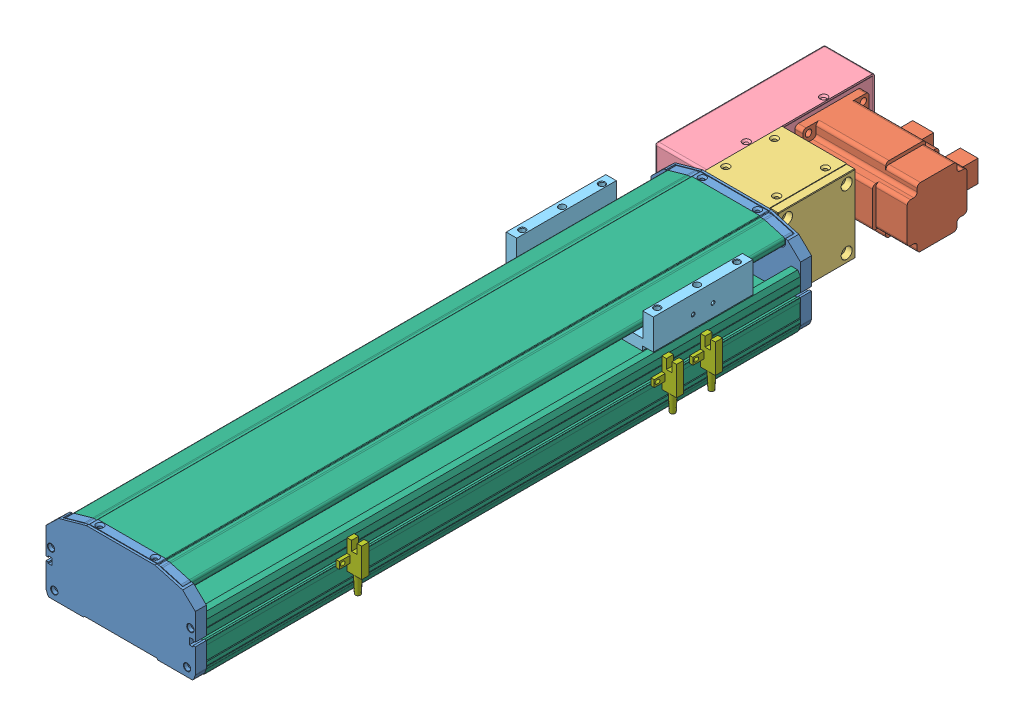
SolidWorks assembly TCD135-T-J4B-0.SLDASM, configuration 300 (file format 9000). Lengths in mm.
Overall size (155.15 78 715.8).
10 component instances, 7 part files, 28 mates.
Components (placement in the parent):
- TCD135-T-J4B-5-1: TCD135-T-J4B-5.SLDPRT [默认] at origin
- TCD135-T-J4B-3-1: TCD135-T-J4B-3.SLDPRT [默认] at (-22.25 36.65 -111.8) x (0 0 1) z (1 0 0)
- TCD135-T-J4B-4-1: TCD135-T-J4B-4.SLDPRT [默认] at (-29.25 36.9 -35) x (0 -1 0) z (1 0 0)
- TCD135-T-J4B-6-1: TCD135-T-J4B-6.SLDPRT [默认] at (-29.25 36.65 -76.75) x (0 0 1) z (-1 0 0)
- TCD135-T-J4B-5-2: TCD135-T-J4B-5.SLDPRT [默认] at (0 0 557) x (-1 0 0) z (0 0 -1)
- TCD135-T-J4B-1-1: TCD135-T-J4B-1.sldprt [默认] at (0 33.9 97)
- TCD135-T-J4B-2-2: TCD135-T-J4B-2.SLDPRT [300] at (0 0 10) x (-1 0 0) z (0 0 -1) size (135 73.5 537)
- TCD135-T-J4B-7-1: TCD135-T-J4B-7.sldprt [默认] at (11 -5.2004 -11.2996)
- TCD135-T-J4B-7-2: TCD135-T-J4B-7.sldprt [默认] at (11 -5.2004 -46.2996)
- TCD135-T-J4B-7-3: TCD135-T-J4B-7.sldprt [默认] at (11 -5.2004 273.3004)
Mates (geometry in assembly coordinates):
- 重合1: coincident anti-aligned: plane of TCD135-T-J4B-3-1 through (-29.25 63.65 -84.8) normal (-1 0 0); plane of TCD135-T-J4B-6-1 through (-29.25 36.65 -76.75) normal (1 0 0)
- 距离1: distance = 11.7 mm aligned: plane of TCD135-T-J4B-3-1 through (69.15 21.65 -141.8) normal (0 0 -1); plane of TCD135-T-J4B-6-1 through (-74.25 1.4 -153.5) normal (0 0 -1)
- 距离2: distance = 5.25 mm aligned: plane of TCD135-T-J4B-3-1 through (69.15 66.65 -126.8) normal (0 1 0); plane of TCD135-T-J4B-6-1 through (-74.25 71.9 -153.5) normal (0 1 0)
- 重合2: coincident aligned: plane of TCD135-T-J4B-4-1 through (29.25 71.9 0) normal (0 0 1); plane of TCD135-T-J4B-6-1 through (-74.25 1.4 0) normal (0 0 1)
- 重合4: coincident anti-aligned: plane of TCD135-T-J4B-4-1 through (-29.25 36.9 -35) normal (-1 0 0); plane of TCD135-T-J4B-6-1 through (-29.25 36.65 -76.75) normal (1 0 0)
- 重合5: coincident aligned: plane of TCD135-T-J4B-5-1 through (30.5 71.9 -105.7277) normal (0 1 0); plane of TCD135-T-J4B-4-1 through (29.25 71.9 0) normal (0 1 0)
- 距离5: distance = 30.25 mm aligned: plane of TCD135-T-J4B-4-1 through (37.25 36.9 -35) normal (1 0 0); plane of TCD135-T-J4B-5-1 through (67.5 29.8 10) normal (1 0 0)
- 重合6: coincident anti-aligned: plane of TCD135-T-J4B-5-1 through (64.1333 0.9 0) normal (0 0 -1); plane of TCD135-T-J4B-4-1 through (29.25 71.9 0) normal (0 0 1)
- 重合17: coincident aligned: plane of TCD135-T-J4B-4-1 through (29.25 71.9 0) normal (0 1 0); plane of TCD135-T-J4B-6-1 through (-74.25 71.9 -153.5) normal (0 1 0)
- LimitDistance1: limit distance = 122 mm aligned: plane of TCD135-T-J4B-4-1 through (29.25 71.9 -70) normal (0 0 -1); plane of TCD135-T-J4B-1-1 through (0 60.65 52) normal (0 0 -1)
- LimitDistance2: limit distance = 415 mm aligned: plane of TCD135-T-J4B-1-1 through (0 60.65 142) normal (0 0 1); plane of TCD135-T-J4B-5-2 through (-64.1333 0.9 557) normal (0 0 1)
- 重合18: coincident anti-aligned: plane of TCD135-T-J4B-5-1 through (64.1333 0.9 10) normal (0 0 1); plane of TCD135-T-J4B-2-2 through (67.5 6 10) normal (0 0 -1)
- 重合19: coincident aligned: plane of TCD135-T-J4B-5-1 through (30.5 71.9 -105.7277) normal (0 1 0); plane of TCD135-T-J4B-2-2 through (-30.5 71.9 547) normal (0 1 0)
- 重合20: coincident aligned: plane of TCD135-T-J4B-5-1 through (-67.5 29.8 10) normal (-1 0 0); plane of TCD135-T-J4B-2-2 through (-67.5 22.5 547) normal (-1 0 0)
- 距离7: distance = 0.5 mm aligned: plane of TCD135-T-J4B-1-1 through (-66.5 62.65 97) normal (-1 0 0); plane of TCD135-T-J4B-2-2 through (-67 10 547) normal (-1 0 0)
- 重合21: coincident aligned: plane of TCD135-T-J4B-5-2 through (-67.5 29.8 547) normal (-1 0 0); plane of TCD135-T-J4B-2-2 through (-67.5 30.1 547) normal (-1 0 0)
- 重合22: coincident aligned: plane of TCD135-T-J4B-5-2 through (-30.5 71.9 662.7277) normal (0 1 0); plane of TCD135-T-J4B-2-2 through (-30.5 71.9 547) normal (0 1 0)
- 重合23: coincident anti-aligned: plane of TCD135-T-J4B-5-2 through (-64.1333 0.9 547) normal (0 0 -1); plane of TCD135-T-J4B-2-2 through (67.5 6 547) normal (0 0 1)
- 距离8: distance = 78 mm anti-aligned: plane of TCD135-T-J4B-1-1 through (-61.75 76.4 97) normal (0 1 0); plane of TCD135-T-J4B-2-2 through (-34.1 -1.6 547) normal (0 -1 0)
- 重合24: coincident anti-aligned: plane of TCD135-T-J4B-2-2 through (67.5 35.625 547) normal (1 0 0); plane of TCD135-T-J4B-7-1 through (67.5 17 145.2) normal (-1 0 0)
- 重合25: coincident aligned: plane of TCD135-T-J4B-2-2 through (65.8 26.2 547) normal (0 1 0); plane of TCD135-T-J4B-7-1 through (67.5 26.2 141.7367) normal (0 1 0)
- 重合26: coincident anti-aligned: plane of TCD135-T-J4B-2-2 through (67.5 35.625 547) normal (1 0 0); plane of TCD135-T-J4B-7-2 through (67.5 17 110.2) normal (-1 0 0)
- 重合27: coincident aligned: plane of TCD135-T-J4B-2-2 through (65.8 26.2 547) normal (0 1 0); plane of TCD135-T-J4B-7-2 through (67.5 26.2 106.7367) normal (0 1 0)
- 重合28: coincident anti-aligned: plane of TCD135-T-J4B-2-2 through (67.5 35.625 547) normal (1 0 0); plane of TCD135-T-J4B-7-3 through (67.5 17 429.8) normal (-1 0 0)
- 重合29: coincident aligned: plane of TCD135-T-J4B-2-2 through (65.8 26.2 547) normal (0 1 0); plane of TCD135-T-J4B-7-3 through (67.5 26.2 426.3367) normal (0 1 0)
- 距离9: distance = 35 mm aligned: plane of TCD135-T-J4B-7-1 through (67.5 17 129) normal (0 0 -1); plane of TCD135-T-J4B-7-2 through (67.5 17 94) normal (0 0 -1)
- 距离10: distance = 94 mm aligned: plane of TCD135-T-J4B-7-2 through (67.5 17 94) normal (0 0 -1); plane of TCD135-T-J4B-5-1 through (64.1333 0.9 0) normal (0 0 -1)
- 距离11: distance = 137 mm aligned: plane of TCD135-T-J4B-7-3 through (67.5 17 420) normal (0 0 1); plane of TCD135-T-J4B-5-2 through (-64.1333 0.9 557) normal (0 0 1)
